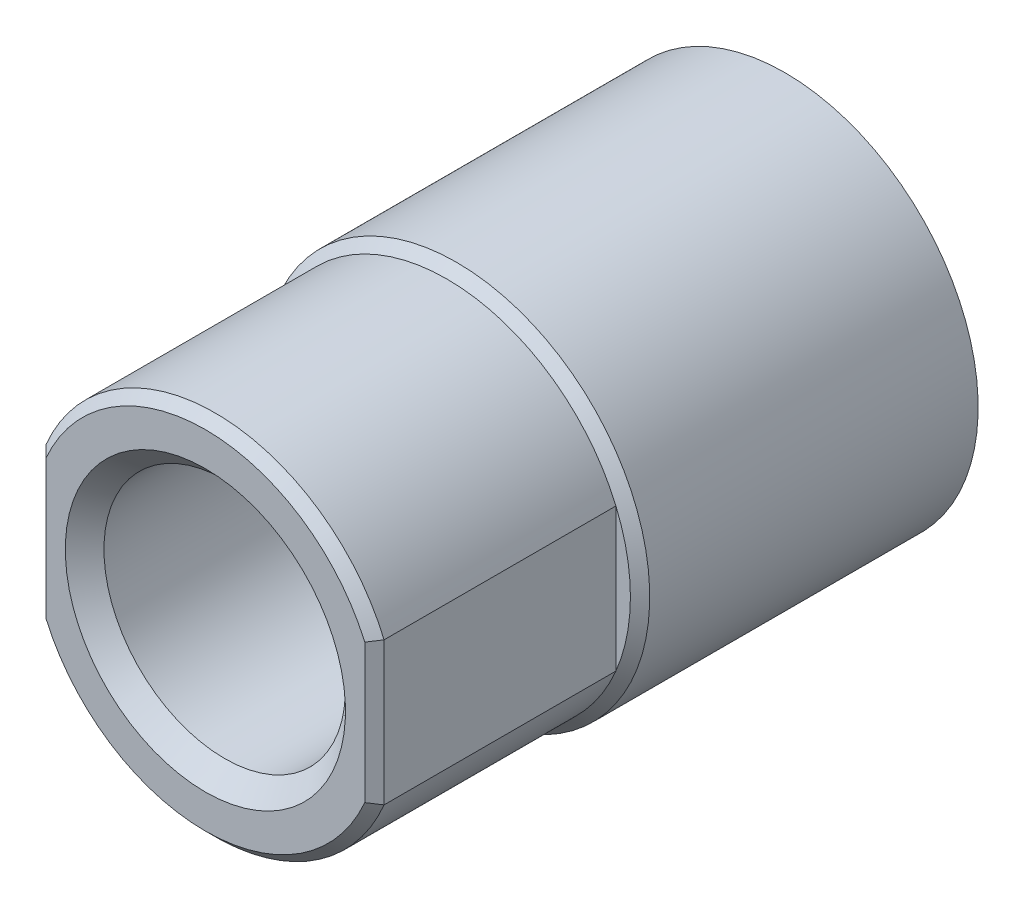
ISO-10303-21;
HEADER;
FILE_DESCRIPTION(('STEP AP214'),'2;1');
FILE_NAME('part.step','',(''),(''),'','','');
FILE_SCHEMA(('AUTOMOTIVE_DESIGN { 1 0 10303 214 1 1 1 1 }'));
ENDSEC;
DATA;
#1=APPLICATION_CONTEXT('core data for automotive mechanical design processes');
#2=APPLICATION_PROTOCOL_DEFINITION('international standard','automotive_design',2000,#1);
#3=PRODUCT_CONTEXT('',#1,'mechanical');
#4=PRODUCT('Part','Part','',(#3));
#5=PRODUCT_RELATED_PRODUCT_CATEGORY('part','',(#4));
#6=PRODUCT_DEFINITION_FORMATION('','',#4);
#7=PRODUCT_DEFINITION_CONTEXT('part definition',#1,'design');
#8=PRODUCT_DEFINITION('design','',#6,#7);
#9=PRODUCT_DEFINITION_SHAPE('','',#8);
#10=(LENGTH_UNIT() NAMED_UNIT(*) SI_UNIT(.MILLI.,.METRE.));
#11=(NAMED_UNIT(*) PLANE_ANGLE_UNIT() SI_UNIT($,.RADIAN.));
#12=(NAMED_UNIT(*) SI_UNIT($,.STERADIAN.) SOLID_ANGLE_UNIT());
#13=UNCERTAINTY_MEASURE_WITH_UNIT(LENGTH_MEASURE(1.E-05),#10,'distance_accuracy_value','');
#14=(GEOMETRIC_REPRESENTATION_CONTEXT(3) GLOBAL_UNCERTAINTY_ASSIGNED_CONTEXT((#13)) GLOBAL_UNIT_ASSIGNED_CONTEXT((#10,
#11,#12)) REPRESENTATION_CONTEXT('',''));
#15=CARTESIAN_POINT('',(0.,0.,0.));
#16=DIRECTION('',(0.,0.,1.));
#17=DIRECTION('',(1.,0.,0.));
#18=AXIS2_PLACEMENT_3D('',#15,#16,#17);
#19=CARTESIAN_POINT('',(0.,0.,12.));
#20=DIRECTION('',(0.,0.,-1.));
#21=DIRECTION('',(0.,1.,0.));
#22=AXIS2_PLACEMENT_3D('',#19,#20,#21);
#23=CYLINDRICAL_SURFACE('',#22,4.);
#24=CARTESIAN_POINT('',(0.,0.,6.8));
#25=DIRECTION('',(0.,0.,-1.));
#26=DIRECTION('',(0.,1.,0.));
#27=AXIS2_PLACEMENT_3D('',#24,#25,#26);
#28=CIRCLE('',#27,4.);
#29=CARTESIAN_POINT('',(0.,4.,6.8));
#30=VERTEX_POINT('',#29);
#31=EDGE_CURVE('E91',#30,#30,#28,.T.);
#32=ORIENTED_EDGE('',*,*,#31,.T.);
#33=EDGE_LOOP('',(#32));
#34=FACE_BOUND('',#33,.T.);
#35=CARTESIAN_POINT('',(0.,0.,0.));
#36=DIRECTION('',(0.,0.,-1.));
#37=DIRECTION('',(0.,1.,0.));
#38=AXIS2_PLACEMENT_3D('',#35,#36,#37);
#39=CIRCLE('',#38,4.);
#40=CARTESIAN_POINT('',(0.,4.,0.));
#41=VERTEX_POINT('',#40);
#42=EDGE_CURVE('E184',#41,#41,#39,.T.);
#43=ORIENTED_EDGE('',*,*,#42,.F.);
#44=EDGE_LOOP('',(#43));
#45=FACE_BOUND('',#44,.T.);
#46=ADVANCED_FACE('F14',(#34,#45),#23,.T.);
#47=CARTESIAN_POINT('',(0.,0.,-15.5));
#48=DIRECTION('',(0.,0.,-1.));
#49=DIRECTION('',(0.,1.,0.));
#50=AXIS2_PLACEMENT_3D('',#47,#48,#49);
#51=CYLINDRICAL_SURFACE('',#50,3.8);
#52=DIRECTION('',(0.,0.,-1.));
#53=VECTOR('',#52,1.);
#54=CARTESIAN_POINT('',(-3.5,1.47986485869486,-15.5));
#55=LINE('',#54,#53);
#56=CARTESIAN_POINT('',(-3.5,1.47986485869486,11.8));
#57=VERTEX_POINT('',#56);
#58=CARTESIAN_POINT('',(-3.5,1.47986485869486,7.));
#59=VERTEX_POINT('',#58);
#60=EDGE_CURVE('E95',#57,#59,#55,.T.);
#61=ORIENTED_EDGE('',*,*,#60,.F.);
#62=CARTESIAN_POINT('',(0.,0.,11.8));
#63=DIRECTION('',(0.,0.,1.));
#64=DIRECTION('',(0.,-1.,0.));
#65=AXIS2_PLACEMENT_3D('',#62,#63,#64);
#66=CIRCLE('',#65,3.8);
#67=CARTESIAN_POINT('',(3.5,1.47986485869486,11.8));
#68=VERTEX_POINT('',#67);
#69=EDGE_CURVE('E9',#57,#68,#66,.F.);
#70=ORIENTED_EDGE('',*,*,#69,.T.);
#71=DIRECTION('',(0.,0.,-1.));
#72=VECTOR('',#71,1.);
#73=CARTESIAN_POINT('',(3.5,1.47986485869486,-15.5));
#74=LINE('',#73,#72);
#75=CARTESIAN_POINT('',(3.5,1.47986485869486,7.));
#76=VERTEX_POINT('',#75);
#77=EDGE_CURVE('E66',#76,#68,#74,.F.);
#78=ORIENTED_EDGE('',*,*,#77,.F.);
#79=CARTESIAN_POINT('',(0.,0.,7.));
#80=DIRECTION('',(0.,0.,-1.));
#81=DIRECTION('',(0.,1.,0.));
#82=AXIS2_PLACEMENT_3D('',#79,#80,#81);
#83=CIRCLE('',#82,3.8);
#84=EDGE_CURVE('E69',#59,#76,#83,.T.);
#85=ORIENTED_EDGE('',*,*,#84,.F.);
#86=EDGE_LOOP('',(#61,#70,#78,#85));
#87=FACE_BOUND('',#86,.T.);
#88=ADVANCED_FACE('F68',(#87),#51,.T.);
#89=DIRECTION('',(0.,0.,-1.));
#90=VECTOR('',#89,1.);
#91=CARTESIAN_POINT('',(3.5,-1.47986485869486,-15.5));
#92=LINE('',#91,#90);
#93=CARTESIAN_POINT('',(3.5,-1.47986485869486,11.8));
#94=VERTEX_POINT('',#93);
#95=CARTESIAN_POINT('',(3.5,-1.47986485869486,7.));
#96=VERTEX_POINT('',#95);
#97=EDGE_CURVE('E73',#94,#96,#92,.T.);
#98=ORIENTED_EDGE('',*,*,#97,.F.);
#99=CARTESIAN_POINT('',(0.,0.,11.8));
#100=DIRECTION('',(0.,0.,1.));
#101=DIRECTION('',(0.,-1.,0.));
#102=AXIS2_PLACEMENT_3D('',#99,#100,#101);
#103=CIRCLE('',#102,3.8);
#104=CARTESIAN_POINT('',(-3.5,-1.47986485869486,11.8));
#105=VERTEX_POINT('',#104);
#106=EDGE_CURVE('E115',#94,#105,#103,.F.);
#107=ORIENTED_EDGE('',*,*,#106,.T.);
#108=DIRECTION('',(0.,0.,-1.));
#109=VECTOR('',#108,1.);
#110=CARTESIAN_POINT('',(-3.5,-1.47986485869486,-15.5));
#111=LINE('',#110,#109);
#112=CARTESIAN_POINT('',(-3.5,-1.47986485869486,7.));
#113=VERTEX_POINT('',#112);
#114=EDGE_CURVE('E99',#113,#105,#111,.F.);
#115=ORIENTED_EDGE('',*,*,#114,.F.);
#116=EDGE_CURVE('E92',#96,#113,#83,.T.);
#117=ORIENTED_EDGE('',*,*,#116,.F.);
#118=EDGE_LOOP('',(#98,#107,#115,#117));
#119=FACE_BOUND('',#118,.T.);
#120=ADVANCED_FACE('F197',(#119),#51,.T.);
#121=CARTESIAN_POINT('',(0.,0.,7.));
#122=DIRECTION('',(0.,0.,-1.));
#123=DIRECTION('',(0.,1.,0.));
#124=AXIS2_PLACEMENT_3D('',#121,#122,#123);
#125=CONICAL_SURFACE('',#124,3.8,0.78539816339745);
#126=ORIENTED_EDGE('',*,*,#31,.F.);
#127=EDGE_LOOP('',(#126));
#128=FACE_BOUND('',#127,.T.);
#129=EDGE_CURVE('E80',#76,#96,#83,.T.);
#130=ORIENTED_EDGE('',*,*,#129,.T.);
#131=ORIENTED_EDGE('',*,*,#116,.T.);
#132=EDGE_CURVE('E83',#113,#59,#83,.T.);
#133=ORIENTED_EDGE('',*,*,#132,.T.);
#134=ORIENTED_EDGE('',*,*,#84,.T.);
#135=EDGE_LOOP('',(#130,#131,#133,#134));
#136=FACE_BOUND('',#135,.T.);
#137=ADVANCED_FACE('F78',(#128,#136),#125,.T.);
#138=CARTESIAN_POINT('',(3.5,5.5,13.));
#139=DIRECTION('',(-1.,0.,0.));
#140=DIRECTION('',(0.,0.,-1.));
#141=AXIS2_PLACEMENT_3D('',#138,#139,#140);
#142=PLANE('',#141);
#143=ORIENTED_EDGE('',*,*,#77,.T.);
#144=DIRECTION('',(0.,-1.,0.));
#145=VECTOR('',#144,1.);
#146=CARTESIAN_POINT('',(3.5,-1.47986485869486,11.8));
#147=LINE('',#146,#145);
#148=EDGE_CURVE('E24',#68,#94,#147,.T.);
#149=ORIENTED_EDGE('',*,*,#148,.T.);
#150=ORIENTED_EDGE('',*,*,#97,.T.);
#151=DIRECTION('',(0.,-1.,0.));
#152=VECTOR('',#151,1.);
#153=CARTESIAN_POINT('',(3.5,5.5,7.));
#154=LINE('',#153,#152);
#155=EDGE_CURVE('E90',#76,#96,#154,.T.);
#156=ORIENTED_EDGE('',*,*,#155,.F.);
#157=EDGE_LOOP('',(#143,#149,#150,#156));
#158=FACE_BOUND('',#157,.T.);
#159=ADVANCED_FACE('F93',(#158),#142,.F.);
#160=CARTESIAN_POINT('',(3.5,5.5,7.));
#161=DIRECTION('',(0.,0.,-1.));
#162=DIRECTION('',(0.,1.,0.));
#163=AXIS2_PLACEMENT_3D('',#160,#161,#162);
#164=PLANE('',#163);
#165=ORIENTED_EDGE('',*,*,#155,.T.);
#166=ORIENTED_EDGE('',*,*,#129,.F.);
#167=EDGE_LOOP('',(#165,#166));
#168=FACE_BOUND('',#167,.T.);
#169=ADVANCED_FACE('F89',(#168),#164,.F.);
#170=CARTESIAN_POINT('',(-3.5,5.5,13.));
#171=DIRECTION('',(1.,0.,0.));
#172=DIRECTION('',(0.,0.,1.));
#173=AXIS2_PLACEMENT_3D('',#170,#171,#172);
#174=PLANE('',#173);
#175=ORIENTED_EDGE('',*,*,#114,.T.);
#176=DIRECTION('',(0.,1.,0.));
#177=VECTOR('',#176,1.);
#178=CARTESIAN_POINT('',(-3.5,1.47986485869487,11.8));
#179=LINE('',#178,#177);
#180=EDGE_CURVE('E72',#105,#57,#179,.T.);
#181=ORIENTED_EDGE('',*,*,#180,.T.);
#182=ORIENTED_EDGE('',*,*,#60,.T.);
#183=DIRECTION('',(0.,-1.,0.));
#184=VECTOR('',#183,1.);
#185=CARTESIAN_POINT('',(-3.5,5.5,7.));
#186=LINE('',#185,#184);
#187=EDGE_CURVE('E94',#59,#113,#186,.T.);
#188=ORIENTED_EDGE('',*,*,#187,.T.);
#189=EDGE_LOOP('',(#175,#181,#182,#188));
#190=FACE_BOUND('',#189,.T.);
#191=ADVANCED_FACE('F174',(#190),#174,.F.);
#192=CARTESIAN_POINT('',(-5.5,5.5,7.));
#193=DIRECTION('',(0.,0.,-1.));
#194=DIRECTION('',(0.,1.,0.));
#195=AXIS2_PLACEMENT_3D('',#192,#193,#194);
#196=PLANE('',#195);
#197=ORIENTED_EDGE('',*,*,#187,.F.);
#198=ORIENTED_EDGE('',*,*,#132,.F.);
#199=EDGE_LOOP('',(#197,#198));
#200=FACE_BOUND('',#199,.T.);
#201=ADVANCED_FACE('F203',(#200),#196,.F.);
#202=CARTESIAN_POINT('',(0.,0.,12.));
#203=DIRECTION('',(0.,0.,1.));
#204=DIRECTION('',(0.,-1.,0.));
#205=AXIS2_PLACEMENT_3D('',#202,#203,#204);
#206=PLANE('',#205);
#207=CARTESIAN_POINT('',(0.,0.,12.));
#208=DIRECTION('',(0.,0.,1.));
#209=DIRECTION('',(0.,-1.,0.));
#210=AXIS2_PLACEMENT_3D('',#207,#208,#209);
#211=CIRCLE('',#210,3.6);
#212=CARTESIAN_POINT('',(3.3,1.43874945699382,12.));
#213=VERTEX_POINT('',#212);
#214=CARTESIAN_POINT('',(-3.3,1.43874945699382,12.));
#215=VERTEX_POINT('',#214);
#216=EDGE_CURVE('E106',#213,#215,#211,.T.);
#217=ORIENTED_EDGE('',*,*,#216,.T.);
#218=DIRECTION('',(0.,-1.,0.));
#219=VECTOR('',#218,1.);
#220=CARTESIAN_POINT('',(-3.3,-1.47986485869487,12.));
#221=LINE('',#220,#219);
#222=CARTESIAN_POINT('',(-3.3,-1.43874945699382,12.));
#223=VERTEX_POINT('',#222);
#224=EDGE_CURVE('E112',#215,#223,#221,.T.);
#225=ORIENTED_EDGE('',*,*,#224,.T.);
#226=CARTESIAN_POINT('',(0.,0.,12.));
#227=DIRECTION('',(0.,0.,1.));
#228=DIRECTION('',(0.,-1.,0.));
#229=AXIS2_PLACEMENT_3D('',#226,#227,#228);
#230=CIRCLE('',#229,3.6);
#231=CARTESIAN_POINT('',(3.3,-1.43874945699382,12.));
#232=VERTEX_POINT('',#231);
#233=EDGE_CURVE('E110',#223,#232,#230,.T.);
#234=ORIENTED_EDGE('',*,*,#233,.T.);
#235=DIRECTION('',(0.,1.,0.));
#236=VECTOR('',#235,1.);
#237=CARTESIAN_POINT('',(3.3,1.47986485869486,12.));
#238=LINE('',#237,#236);
#239=EDGE_CURVE('E108',#232,#213,#238,.T.);
#240=ORIENTED_EDGE('',*,*,#239,.T.);
#241=EDGE_LOOP('',(#217,#225,#234,#240));
#242=FACE_BOUND('',#241,.T.);
#243=CARTESIAN_POINT('',(0.,0.,12.));
#244=DIRECTION('',(0.,0.,1.));
#245=DIRECTION('',(0.,-1.,0.));
#246=AXIS2_PLACEMENT_3D('',#243,#244,#245);
#247=CIRCLE('',#246,2.9);
#248=CARTESIAN_POINT('',(0.,-2.9,12.));
#249=VERTEX_POINT('',#248);
#250=EDGE_CURVE('E85',#249,#249,#247,.T.);
#251=ORIENTED_EDGE('',*,*,#250,.F.);
#252=EDGE_LOOP('',(#251));
#253=FACE_BOUND('',#252,.T.);
#254=ADVANCED_FACE('F170',(#242,#253),#206,.T.);
#255=CARTESIAN_POINT('',(0.,0.,12.));
#256=DIRECTION('',(0.,0.,1.));
#257=DIRECTION('',(0.,-1.,0.));
#258=AXIS2_PLACEMENT_3D('',#255,#256,#257);
#259=CONICAL_SURFACE('',#258,2.9,0.785398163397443);
#260=CARTESIAN_POINT('',(0.,0.,11.6));
#261=DIRECTION('',(0.,0.,1.));
#262=DIRECTION('',(0.,-1.,0.));
#263=AXIS2_PLACEMENT_3D('',#260,#261,#262);
#264=CIRCLE('',#263,2.5);
#265=CARTESIAN_POINT('',(0.,-2.5,11.6));
#266=VERTEX_POINT('',#265);
#267=EDGE_CURVE('E19',#266,#266,#264,.F.);
#268=ORIENTED_EDGE('',*,*,#267,.T.);
#269=EDGE_LOOP('',(#268));
#270=FACE_BOUND('',#269,.T.);
#271=ORIENTED_EDGE('',*,*,#250,.T.);
#272=EDGE_LOOP('',(#271));
#273=FACE_BOUND('',#272,.T.);
#274=ADVANCED_FACE('F202',(#270,#273),#259,.F.);
#275=CARTESIAN_POINT('',(3.5,5.5,11.8));
#276=DIRECTION('',(0.707106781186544,0.,0.707106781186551));
#277=DIRECTION('',(-0.707106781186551,0.,0.707106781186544));
#278=AXIS2_PLACEMENT_3D('',#275,#276,#277);
#279=PLANE('',#278);
#280=CARTESIAN_POINT('',(3.3,1.43874945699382,12.));
#281=CARTESIAN_POINT('',(3.33332361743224,1.44569655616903,11.9666763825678));
#282=CARTESIAN_POINT('',(3.36665209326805,1.45259638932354,11.933347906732));
#283=CARTESIAN_POINT('',(3.43331875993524,1.46630152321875,11.8666812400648));
#284=CARTESIAN_POINT('',(3.4666569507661,1.4731068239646,11.8333430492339));
#285=CARTESIAN_POINT('',(3.5,1.47986485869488,11.8));
#286=B_SPLINE_CURVE_WITH_KNOTS('',3,(#280,#281,#282,#283,#284,#285),.UNSPECIFIED.,.F.,.F.,(4,2,
4),(0.,0.142907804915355,0.28581560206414),.UNSPECIFIED.);
#287=EDGE_CURVE('E152',#213,#68,#286,.T.);
#288=ORIENTED_EDGE('',*,*,#287,.F.);
#289=ORIENTED_EDGE('',*,*,#239,.F.);
#290=CARTESIAN_POINT('',(3.3,-1.43874945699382,12.));
#291=CARTESIAN_POINT('',(3.33332361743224,-1.44569655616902,11.9666763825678));
#292=CARTESIAN_POINT('',(3.36665209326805,-1.45259638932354,11.933347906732));
#293=CARTESIAN_POINT('',(3.43331875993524,-1.46630152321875,11.8666812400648));
#294=CARTESIAN_POINT('',(3.4666569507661,-1.4731068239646,11.8333430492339));
#295=CARTESIAN_POINT('',(3.5,-1.47986485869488,11.8));
#296=B_SPLINE_CURVE_WITH_KNOTS('',3,(#290,#291,#292,#293,#294,#295),.UNSPECIFIED.,.F.,.F.,(4,2,
4),(0.,0.142907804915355,0.28581560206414),.UNSPECIFIED.);
#297=EDGE_CURVE('E146',#94,#232,#296,.F.);
#298=ORIENTED_EDGE('',*,*,#297,.F.);
#299=ORIENTED_EDGE('',*,*,#148,.F.);
#300=EDGE_LOOP('',(#288,#289,#298,#299));
#301=FACE_BOUND('',#300,.T.);
#302=ADVANCED_FACE('F16',(#301),#279,.T.);
#303=CARTESIAN_POINT('',(0.,0.,11.8));
#304=DIRECTION('',(0.,0.,-1.));
#305=DIRECTION('',(0.,1.,0.));
#306=AXIS2_PLACEMENT_3D('',#303,#304,#305);
#307=CONICAL_SURFACE('',#306,3.8,0.785398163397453);
#308=ORIENTED_EDGE('',*,*,#297,.T.);
#309=ORIENTED_EDGE('',*,*,#233,.F.);
#310=CARTESIAN_POINT('',(-3.3,-1.43874945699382,12.));
#311=CARTESIAN_POINT('',(-3.33332361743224,-1.44569655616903,11.9666763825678));
#312=CARTESIAN_POINT('',(-3.36665209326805,-1.45259638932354,11.933347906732));
#313=CARTESIAN_POINT('',(-3.43331875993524,-1.46630152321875,11.8666812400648));
#314=CARTESIAN_POINT('',(-3.4666569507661,-1.47310682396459,11.8333430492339));
#315=CARTESIAN_POINT('',(-3.5,-1.47986485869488,11.8));
#316=B_SPLINE_CURVE_WITH_KNOTS('',3,(#310,#311,#312,#313,#314,#315),.UNSPECIFIED.,.F.,.F.,(4,2,
4),(0.,0.142907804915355,0.285815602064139),.UNSPECIFIED.);
#317=EDGE_CURVE('E126',#105,#223,#316,.F.);
#318=ORIENTED_EDGE('',*,*,#317,.F.);
#319=ORIENTED_EDGE('',*,*,#106,.F.);
#320=EDGE_LOOP('',(#308,#309,#318,#319));
#321=FACE_BOUND('',#320,.T.);
#322=ADVANCED_FACE('F140',(#321),#307,.T.);
#323=CARTESIAN_POINT('',(0.,0.,11.8));
#324=DIRECTION('',(0.,0.,-1.));
#325=DIRECTION('',(0.,1.,0.));
#326=AXIS2_PLACEMENT_3D('',#323,#324,#325);
#327=CONICAL_SURFACE('',#326,3.8,0.785398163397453);
#328=ORIENTED_EDGE('',*,*,#287,.T.);
#329=ORIENTED_EDGE('',*,*,#69,.F.);
#330=CARTESIAN_POINT('',(-3.5,1.47986485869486,11.8));
#331=CARTESIAN_POINT('',(-3.4666569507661,1.47310682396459,11.8333430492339));
#332=CARTESIAN_POINT('',(-3.43331875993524,1.46630152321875,11.8666812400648));
#333=CARTESIAN_POINT('',(-3.36665209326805,1.45259638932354,11.933347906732));
#334=CARTESIAN_POINT('',(-3.33332361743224,1.44569655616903,11.9666763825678));
#335=CARTESIAN_POINT('',(-3.3,1.43874945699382,12.));
#336=B_SPLINE_CURVE_WITH_KNOTS('',3,(#330,#331,#332,#333,#334,#335),.UNSPECIFIED.,.F.,.F.,(4,2,
4),(0.,0.142907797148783,0.285815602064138),.UNSPECIFIED.);
#337=EDGE_CURVE('E118',#215,#57,#336,.F.);
#338=ORIENTED_EDGE('',*,*,#337,.F.);
#339=ORIENTED_EDGE('',*,*,#216,.F.);
#340=EDGE_LOOP('',(#328,#329,#338,#339));
#341=FACE_BOUND('',#340,.T.);
#342=ADVANCED_FACE('F132',(#341),#327,.T.);
#343=CARTESIAN_POINT('',(-3.5,5.5,11.8));
#344=DIRECTION('',(-0.707106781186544,0.,0.707106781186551));
#345=DIRECTION('',(-0.707106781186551,0.,-0.707106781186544));
#346=AXIS2_PLACEMENT_3D('',#343,#344,#345);
#347=PLANE('',#346);
#348=ORIENTED_EDGE('',*,*,#317,.T.);
#349=ORIENTED_EDGE('',*,*,#224,.F.);
#350=ORIENTED_EDGE('',*,*,#337,.T.);
#351=ORIENTED_EDGE('',*,*,#180,.F.);
#352=EDGE_LOOP('',(#348,#349,#350,#351));
#353=FACE_BOUND('',#352,.T.);
#354=ADVANCED_FACE('F135',(#353),#347,.T.);
#355=CARTESIAN_POINT('',(0.,0.,2.));
#356=DIRECTION('',(0.,0.,1.));
#357=DIRECTION('',(0.,-1.,0.));
#358=AXIS2_PLACEMENT_3D('',#355,#356,#357);
#359=PLANE('',#358);
#360=CARTESIAN_POINT('',(0.,0.,2.));
#361=DIRECTION('',(0.,0.,1.));
#362=DIRECTION('',(0.,-1.,0.));
#363=AXIS2_PLACEMENT_3D('',#360,#361,#362);
#364=CIRCLE('',#363,2.5);
#365=CARTESIAN_POINT('',(0.,-2.5,2.));
#366=VERTEX_POINT('',#365);
#367=EDGE_CURVE('E181',#366,#366,#364,.T.);
#368=ORIENTED_EDGE('',*,*,#367,.T.);
#369=EDGE_LOOP('',(#368));
#370=FACE_BOUND('',#369,.T.);
#371=ADVANCED_FACE('F138',(#370),#359,.T.);
#372=CARTESIAN_POINT('',(0.,0.,2.));
#373=DIRECTION('',(0.,0.,1.));
#374=DIRECTION('',(0.,-1.,0.));
#375=AXIS2_PLACEMENT_3D('',#372,#373,#374);
#376=CYLINDRICAL_SURFACE('',#375,2.5);
#377=ORIENTED_EDGE('',*,*,#367,.F.);
#378=EDGE_LOOP('',(#377));
#379=FACE_BOUND('',#378,.T.);
#380=ORIENTED_EDGE('',*,*,#267,.F.);
#381=EDGE_LOOP('',(#380));
#382=FACE_BOUND('',#381,.T.);
#383=ADVANCED_FACE('F219',(#379,#382),#376,.F.);
#384=CARTESIAN_POINT('',(0.,0.,0.));
#385=DIRECTION('',(0.,0.,-1.));
#386=DIRECTION('',(0.,1.,0.));
#387=AXIS2_PLACEMENT_3D('',#384,#385,#386);
#388=PLANE('',#387);
#389=ORIENTED_EDGE('',*,*,#42,.T.);
#390=EDGE_LOOP('',(#389));
#391=FACE_BOUND('',#390,.T.);
#392=ADVANCED_FACE('F188',(#391),#388,.T.);
#393=CLOSED_SHELL('',(#46,#88,#120,#137,#159,#169,#191,#201,#254,#274,#302,#322,#342,#354,#371,
#383,#392));
#394=MANIFOLD_SOLID_BREP('B1',#393);
#395=ADVANCED_BREP_SHAPE_REPRESENTATION('',(#18,#394),#14);
#396=SHAPE_DEFINITION_REPRESENTATION(#9,#395);
ENDSEC;
END-ISO-10303-21;
